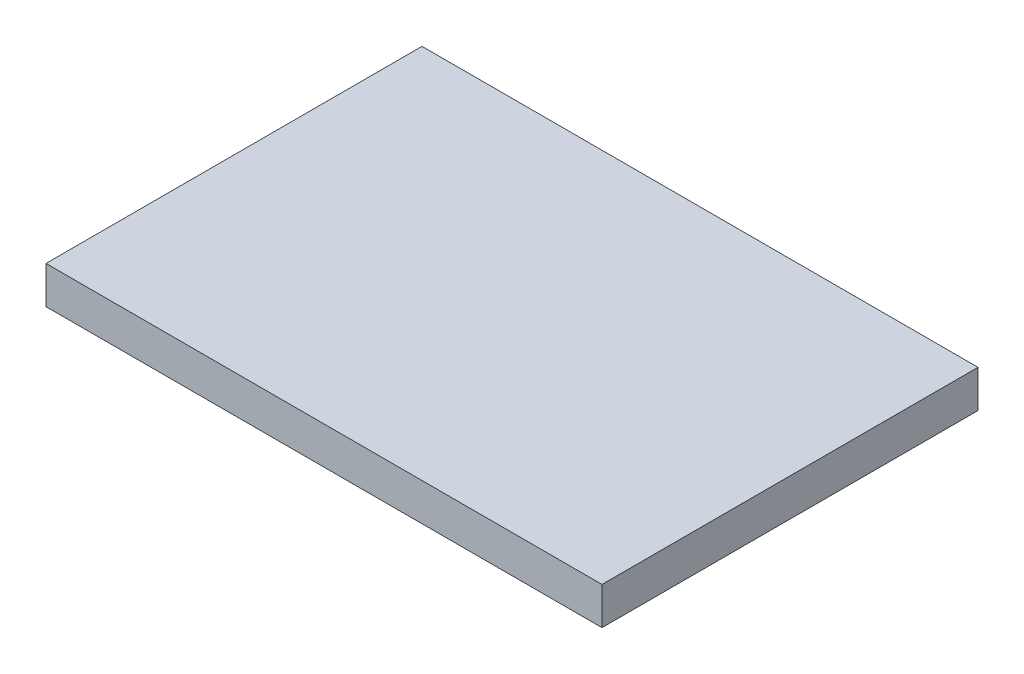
from build123d import *

# Parameters (mm, degrees)
SKETCH2_W      = 219.947915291
SKETCH2_H      = 148.755234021
EXTRUDE1_DEPTH = 14.814180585


with BuildPart() as part:
    # Sketch2 → Extrude1 (new body)
    with BuildSketch(Plane(origin=(0, 0, 0), x_dir=(-1, 0, 0), z_dir=(0, 1, 0))):
        with Locations((-4.49637987, 0.187349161)):
            Rectangle(SKETCH2_W, SKETCH2_H)
    extrude(amount=EXTRUDE1_DEPTH)


solid = part.part
